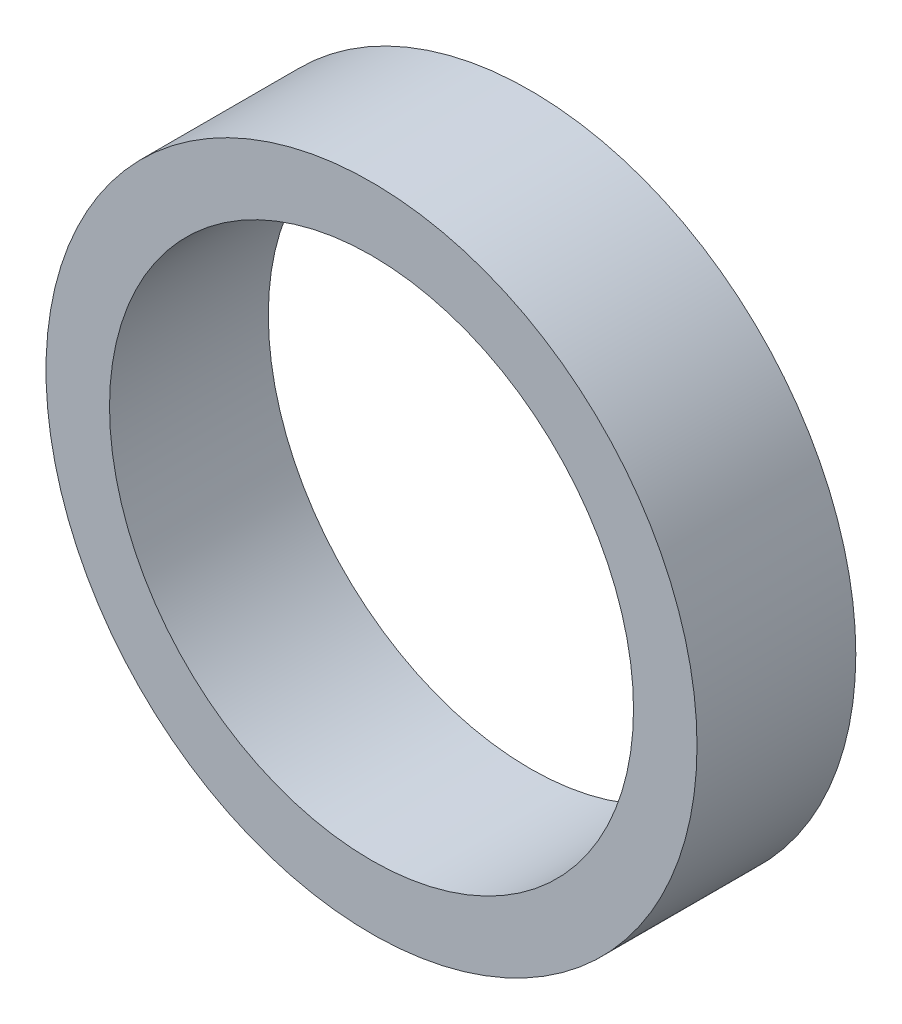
from build123d import *

# Parameters (mm, degrees)
ESQUISSE1_R      = 20.5
ESQUISSE1_R_2    = 16.5
EXTRUSION1_DEPTH = 10


with BuildPart() as part:
    # Esquisse1 → Extrusion1 (new body)
    with BuildSketch(Plane.XY):
        Circle(ESQUISSE1_R)
        Circle(ESQUISSE1_R_2, mode=Mode.SUBTRACT)
    extrude(amount=EXTRUSION1_DEPTH)


solid = part.part
